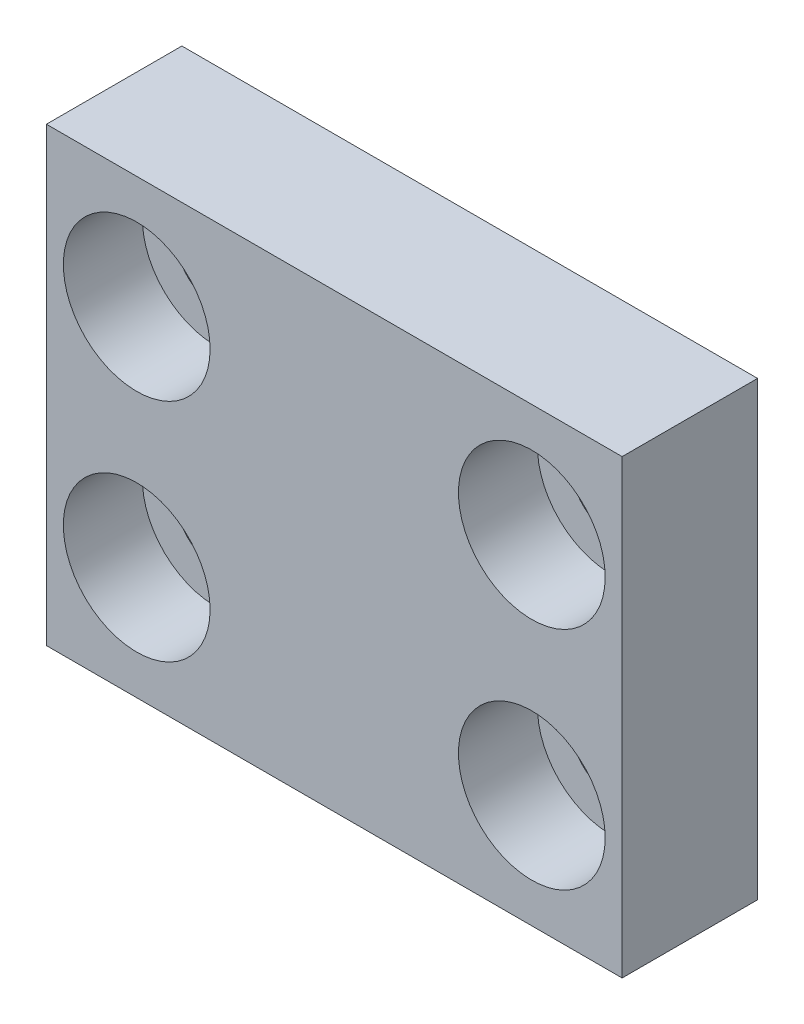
from build123d import *

# Parameters (mm, degrees)
SKETCH_1_W          = 25.5
SKETCH_1_H          = 20
SKETCH_1_R          = 1.75
EXTRUDE_1_DEPTH     = 6
SKETCH_2_R          = 3.25
CUT_EXTRUDE_1_DEPTH = 3.5


with BuildPart() as part:
    # Sketch 1 → Extrude 1 (new body)
    with BuildSketch(Plane.XY):
        with Locations((12.75, -10)):
            Rectangle(SKETCH_1_W, SKETCH_1_H)
        with Locations((4, -15)):
            Circle(SKETCH_1_R, mode=Mode.SUBTRACT)
        with Locations((21.5, -15)):
            Circle(SKETCH_1_R, mode=Mode.SUBTRACT)
        with Locations((21.5, -5)):
            Circle(SKETCH_1_R, mode=Mode.SUBTRACT)
        with Locations((4, -5)):
            Circle(SKETCH_1_R, mode=Mode.SUBTRACT)
    extrude(amount=EXTRUDE_1_DEPTH)

    # Sketch 2 → Cut-Extrude 1 (cut)
    with BuildSketch(Plane.XY.offset(6)):
        with Locations((4, -15)):
            Circle(SKETCH_2_R)
        with Locations((21.5, -15)):
            Circle(SKETCH_2_R)
        with Locations((21.5, -5)):
            Circle(SKETCH_2_R)
        with Locations((4, -5)):
            Circle(SKETCH_2_R)
    extrude(amount=-CUT_EXTRUDE_1_DEPTH, mode=Mode.SUBTRACT)


solid = part.part
